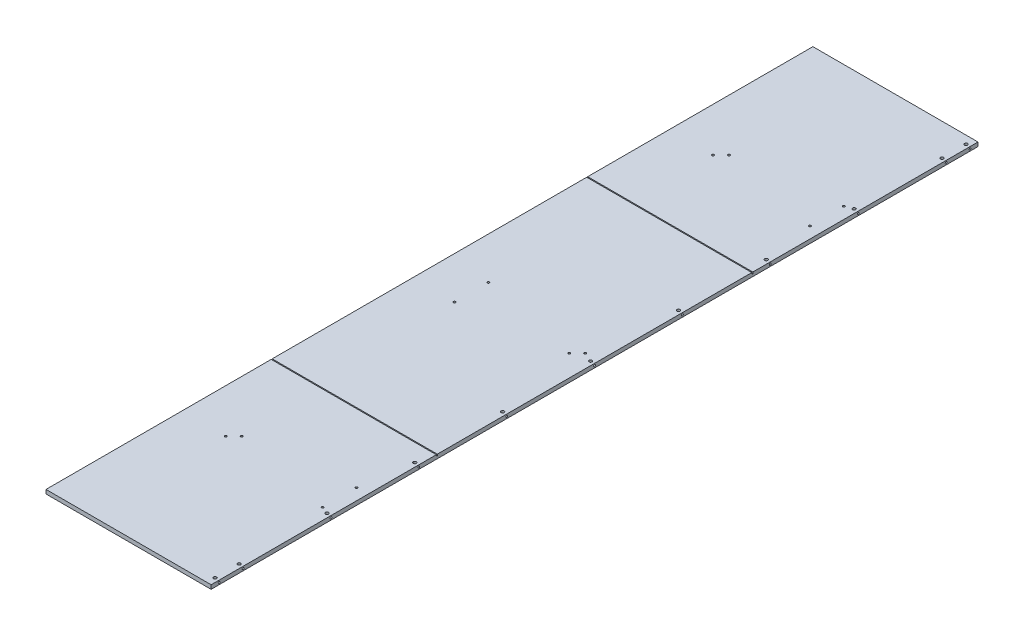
from build123d import *

# Parameters (mm, degrees)
EXTRUDE1_DEPTH     = 12.7
SKETCH2_W          = 657.175988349
SKETCH2_H          = 3.175
CUT_EXTRUDE1_DEPTH = 4.7625
SKETCH3_R          = 3.37312
CUT_EXTRUDE2_DEPTH = 1810.767756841
SKETCH4_R          = 3.37312
CUT_EXTRUDE3_DEPTH = 1810.767756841
SKETCH5_R          = 4.9022
EXTRUDE2_DEPTH     = 1810.767756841
SKETCH6_R          = 2.8067
EXTRUDE3_DEPTH     = 12.7


with BuildPart() as part:
    # Sketch1 → Extrude1 (new body)
    with BuildSketch(Plane(origin=(0, 0, 0), x_dir=(1, 0, 0), z_dir=(0, 1, 0))):
        Polygon((0, 0), (0, 1025.398), (0, 1731.899), (524.99895, 1731.899), (524.99895, 1025.398), (524.99895, 0), (524.99895, -706.501), (0, -706.501), align=None)
    extrude(amount=EXTRUDE1_DEPTH)

    # Sketch2 → Cut-Extrude1 (cut)
    with BuildSketch(Plane(origin=(0, 12.7, 0), x_dir=(1, 0, 0), z_dir=(0, 1, 0))):
        with Locations((264.272391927, 11.1125)):
            Rectangle(SKETCH2_W, SKETCH2_H)
        with Locations((264.272391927, 1014.2855)):
            Rectangle(SKETCH2_W, SKETCH2_H)
    extrude(amount=-CUT_EXTRUDE1_DEPTH, mode=Mode.SUBTRACT)

    # Sketch3 → Cut-Extrude2 (cut, through all)
    with BuildSketch(Plane.XZ):
        with Locations(Location((488.95, -1233.370563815, 0), (0, 0, 270))):
            Circle(SKETCH3_R)
        with Locations(Location((488.95, -1341.320563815, 0), (0, 0, 270))):
            Circle(SKETCH3_R)
        with Locations(Location((482.6, -525.399, 0), (0, 0, 270))):
            Circle(SKETCH3_R)
        with Locations(Location((488.95, 316.029436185, 0), (0, 0, 270))):
            Circle(SKETCH3_R)
        with Locations(Location((488.95, 208.079436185, 0), (0, 0, 270))):
            Circle(SKETCH3_R)
        with Locations(Location((165.1, 249.301, 0), (0, 0, 270))):
            Circle(SKETCH3_R)
        with Locations(Location((165.1, -1300.099, 0), (0, 0, 270))):
            Circle(SKETCH3_R)
        with Locations(Location((139.7, -1274.699, 0), (0, 0, 270))):
            Circle(SKETCH3_R)
        with Locations(Location((457.2, -499.999, 0), (0, 0, 270))):
            Circle(SKETCH3_R)
        with Locations(Location((139.7, 274.701, 0), (0, 0, 270))):
            Circle(SKETCH3_R)
    extrude(amount=-CUT_EXTRUDE2_DEPTH, mode=Mode.SUBTRACT)

    # Sketch4 → Cut-Extrude3 (cut, through all)
    with BuildSketch(Plane.XZ):
        with Locations(Location((133.35, -566.620563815, 0), (0, 0, 270))):
            Circle(SKETCH4_R)
        with Locations(Location((133.35, -458.777436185, 0), (0, 0, 270))):
            Circle(SKETCH4_R)
    extrude(amount=-CUT_EXTRUDE3_DEPTH, mode=Mode.SUBTRACT)

    # Sketch5 → Extrude2 (cut, through all)
    with BuildSketch(Plane(origin=(0, 12.7, 0), x_dir=(1, 0, 0), z_dir=(0, 1, 0))):
        with Locations(Location((512.29895, 1630.299, 0), (0, 0, 270))):
            Circle(SKETCH5_R)
        with Locations(Location((512.29895, 1350.899, 0), (0, 0, 270))):
            Circle(SKETCH5_R)
        with Locations(Location((512.29895, 1071.499, 0), (0, 0, 270))):
            Circle(SKETCH5_R)
        with Locations(Location((512.29895, 792.099, 0), (0, 0, 270))):
            Circle(SKETCH5_R)
        with Locations(Location((512.29895, 512.699, 0), (0, 0, 270))):
            Circle(SKETCH5_R)
        with Locations(Location((512.29895, 233.299, 0), (0, 0, 270))):
            Circle(SKETCH5_R)
        with Locations(Location((512.29895, -46.101, 0), (0, 0, 270))):
            Circle(SKETCH5_R)
        with Locations(Location((512.29895, -325.501, 0), (0, 0, 270))):
            Circle(SKETCH5_R)
        with Locations(Location((512.29895, -681.101, 0), (0, 0, 270))):
            Circle(SKETCH5_R)
        with Locations(Location((512.29895, -604.901, 0), (0, 0, 270))):
            Circle(SKETCH5_R)
        with Locations(Location((512.29895, 1706.499, 0), (0, 0, 270))):
            Circle(SKETCH5_R)
    extrude(amount=-EXTRUDE2_DEPTH, mode=Mode.SUBTRACT)

    # Sketch6 → Extrude3 (cut)
    with BuildSketch(Plane(origin=(524.99895, 0, 0), x_dir=(0, 0, -1), z_dir=(1, 0, 0))):
        with Locations((-681.101, 6.35)):
            Circle(SKETCH6_R)
        with Locations((-604.901, 6.35)):
            Circle(SKETCH6_R)
        with Locations((-325.501, 6.35)):
            Circle(SKETCH6_R)
        with Locations((-46.101, 6.35)):
            Circle(SKETCH6_R)
        with Locations((233.299, 6.35)):
            Circle(SKETCH6_R)
        with Locations((512.699, 6.35)):
            Circle(SKETCH6_R)
        with Locations((792.099, 6.35)):
            Circle(SKETCH6_R)
        with Locations((1071.499, 6.35)):
            Circle(SKETCH6_R)
        with Locations((1350.899, 6.35)):
            Circle(SKETCH6_R)
        with Locations((1630.299, 6.35)):
            Circle(SKETCH6_R)
        with Locations((1706.499, 6.35)):
            Circle(SKETCH6_R)
    extrude(amount=-EXTRUDE3_DEPTH, mode=Mode.SUBTRACT)


solid = part.part
